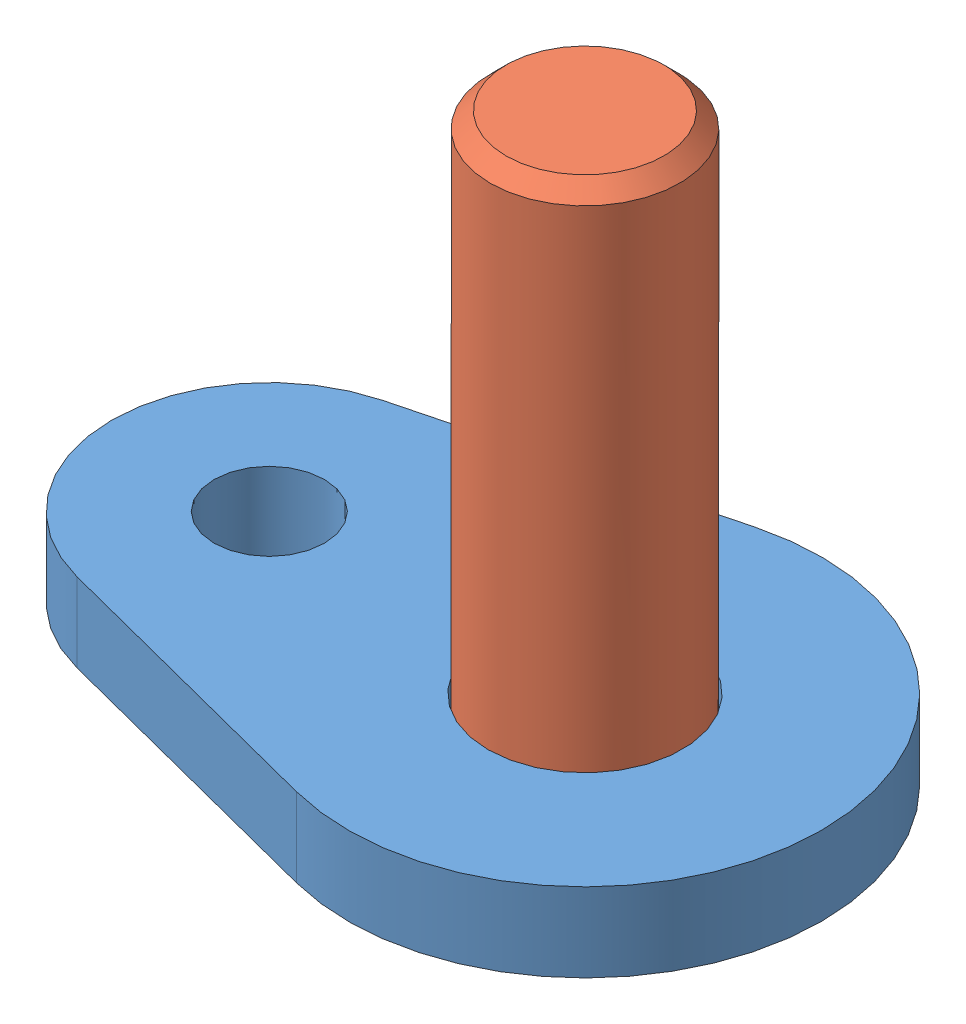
SolidWorks assembly AXE TABLIER ASM.sldasm, configuration Défaut (file format 7000). Lengths in mm.
Overall size (45 37 30).
2 component instances, 2 part files, 2 mates.
Components (placement in the parent):
- PLATINE AXE TABLIER-1: PLATINE AXE TABLIER.SLDPRT [Défaut] at origin size (45 5 30)
- ETIRE AXE TABLIER-1: ETIRE AXE TABLIER.SLDPRT [Défaut] at (0 -5 0) x (-1 0 0) z (0 0 1) size (12 37 12)
Mates (geometry in assembly coordinates):
- Coaxiale1: concentric anti-aligned: cylinder of PLATINE AXE TABLIER-1 through (0 0 0) axis (0 -1 0) radius 6.15; cylinder of ETIRE AXE TABLIER-1 through (0 -5 0) axis (0 1 0) radius 6
- Coïncidente1: coincident aligned: plane of PLATINE AXE TABLIER-1 through (-20 -5 0) normal (0 -1 0); plane of ETIRE AXE TABLIER-1 through (-6 -5 0) normal (0 -1 0)
